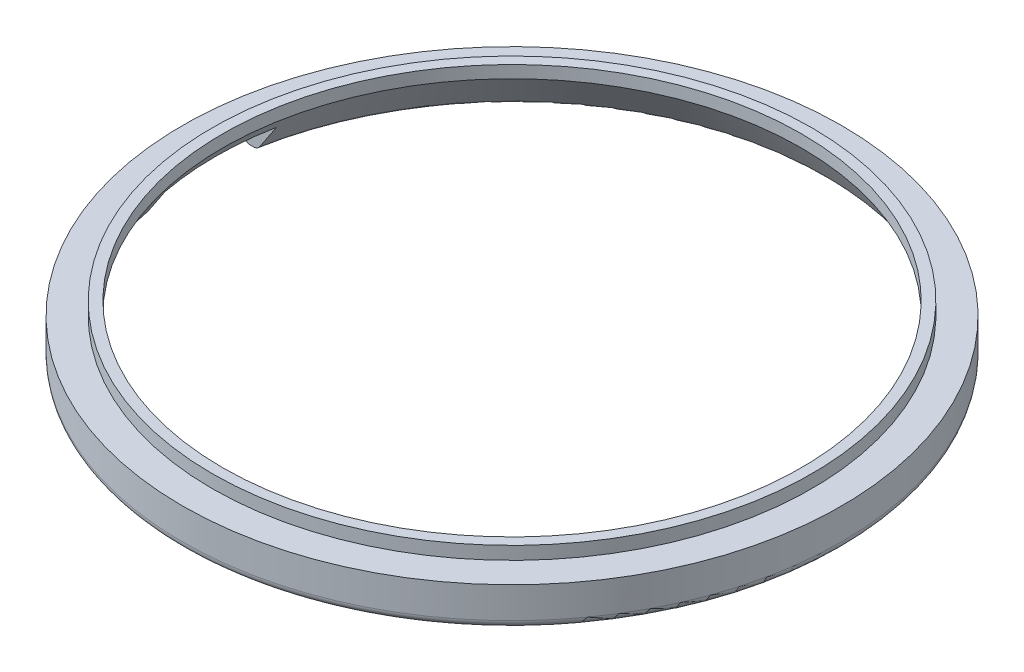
from build123d import *

# Parameters (mm, degrees)
SKETCH1_R           = 12.7
SKETCH1_R_2         = 11.15
BOSS_EXTRUDE1_DEPTH = 2
SKETCH2_W           = 4.3
SKETCH2_H           = 1.1
CUT_EXTRUDE1_DEPTH  = 19.071524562
FILLET2_R           = 0.3
SKETCH6_OUTSIDE_W   = 34.596
SKETCH6_OUTSIDE_H   = 34.596
SKETCH6_OUTSIDE_R   = 11.55
CUT_EXTRUDE4_DEPTH  = 0.5


with BuildPart() as part:
    # Sketch1 → Boss-Extrude1 (new body)
    with BuildSketch(Plane(origin=(0, 0, 0), x_dir=(1, 0, 0), z_dir=(0, 1, 0))):
        with Locations(Location((0, 0, 0), (0, 0, 270))):
            Circle(SKETCH1_R)
        with Locations(Location((0, 0, 0), (0, 0, 270))):
            Circle(SKETCH1_R_2, mode=Mode.SUBTRACT)
    extrude(amount=BOSS_EXTRUDE1_DEPTH)

    # Sketch2 → Cut-Extrude1 (cut, through all)
    with BuildSketch(Plane(origin=(0, 0, 0), x_dir=(0, 0, -1), z_dir=(1, 0, 0))):
        with Locations((0, 0.55)):
            Rectangle(SKETCH2_W, SKETCH2_H)
    extrude(amount=-CUT_EXTRUDE1_DEPTH, mode=Mode.SUBTRACT)

    # Sketch5 → Cut-Revolve1 (revolve, cut)
    with BuildSketch(Plane.XY, mode=Mode.PRIVATE) as cut_revolve1_sk:
        Polygon((12.15, 0), (11.15, 1.525253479), (11.15, 0), align=None)
    revolve(cut_revolve1_sk.sketch.rotate(Axis((0, 0, 0), (0, 1, 0)), 90), axis=Axis((0, 0, 0), (0, 1, 0)), mode=Mode.SUBTRACT)

    # Fillet2
    fillet2_edges = [part.edges().sort_by_distance(p)[0] for p in [
        (9.710689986, 0, -8.184894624),
        (9.32054183, 0, 7.794228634),
        (-12.7, 1.1, 0),
    ]]
    fillet(fillet2_edges, radius=FILLET2_R)

    # Sketch6 outside → Cut-Extrude4 (cut)
    with BuildSketch(Plane(origin=(0, 2, 0), x_dir=(1, 0, 0), z_dir=(0, 1, 0))):
        Rectangle(SKETCH6_OUTSIDE_W, SKETCH6_OUTSIDE_H)
        with Locations(Location((0, 0, 0), (0, 0, 270))):
            Circle(SKETCH6_OUTSIDE_R, mode=Mode.SUBTRACT)
    extrude(amount=-CUT_EXTRUDE4_DEPTH, mode=Mode.SUBTRACT)


solid = part.part
